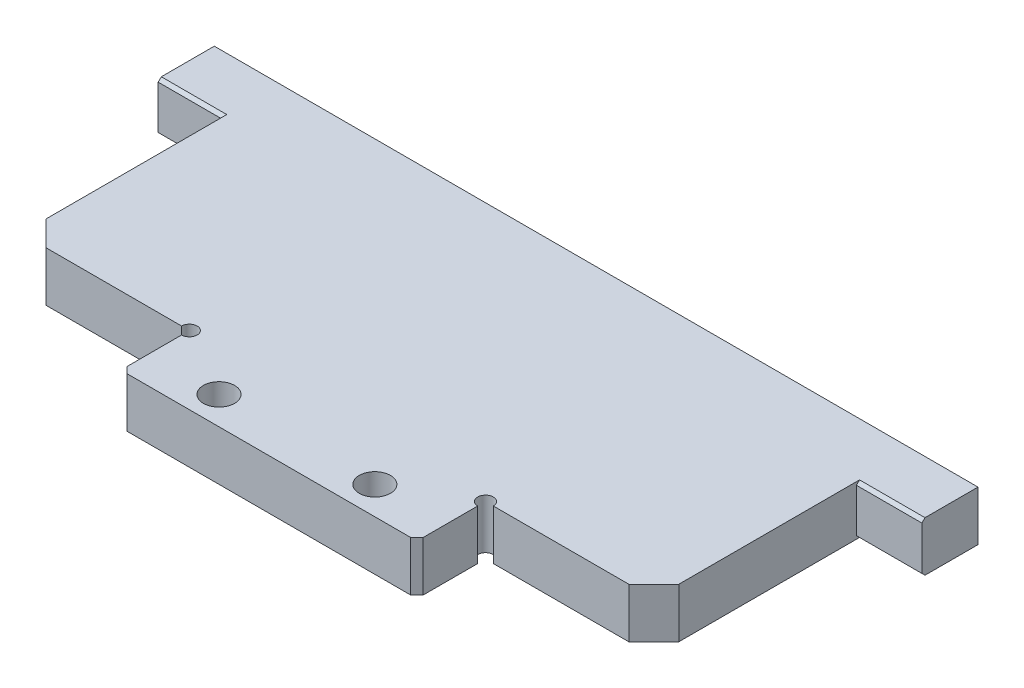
from build123d import *

# Parameters (mm, degrees)
SKETCH1_W           = 245
SKETCH1_H           = 105
BOSS_EXTRUDE1_DEPTH = 16
SKETCH2_W           = 75
SKETCH2_H           = 22
CUT_EXTRUDE1_DEPTH  = 163.133432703
SKETCH3_R           = 2.5
CUT_EXTRUDE2_DEPTH  = 163.133432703
CHAMFER1_SIZE       = 2
SKETCH4_R           = 5
CUT_EXTRUDE3_DEPTH  = 163.133432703
SKETCH5_W           = 21
SKETCH5_H           = 65
CUT_EXTRUDE4_DEPTH  = 163.133432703
CHAMFER2_SIZE       = 8
CHAMFER3_SIZE       = 1


with BuildPart() as part:
    # Sketch1 → Boss-Extrude1 (new body)
    with BuildSketch(Plane(origin=(0, 0, 0), x_dir=(1, 0, 0), z_dir=(0, 1, 0))):
        with Locations((0, 52.5)):
            Rectangle(SKETCH1_W, SKETCH1_H)
    extrude(amount=BOSS_EXTRUDE1_DEPTH)

    # Sketch2 → Cut-Extrude1 (cut, through all)
    with BuildSketch(Plane(origin=(0, 16, 0), x_dir=(1, 0, 0), z_dir=(0, 1, 0))):
        with Locations((-85, 11)):
            Rectangle(SKETCH2_W, SKETCH2_H)
        with Locations((85, 11)):
            Rectangle(SKETCH2_W, SKETCH2_H)
    extrude(amount=-CUT_EXTRUDE1_DEPTH, mode=Mode.SUBTRACT)

    # Sketch3 → Cut-Extrude2 (cut, through all)
    with BuildSketch(Plane(origin=(0, 16, 0), x_dir=(1, 0, 0), z_dir=(0, 1, 0))):
        with Locations((-47.5, 22)):
            Circle(SKETCH3_R)
        with Locations((47.5, 22)):
            Circle(SKETCH3_R)
    extrude(amount=-CUT_EXTRUDE2_DEPTH, mode=Mode.SUBTRACT)

    # Chamfer1
    chamfer1_edges = [part.edges().sort_by_distance(p)[0] for p in [
        (-47.5, 8, 0),
        (47.5, 8, 0),
    ]]
    chamfer(chamfer1_edges, length=CHAMFER1_SIZE)

    # Sketch4 → Cut-Extrude3 (cut, through all)
    with BuildSketch(Plane(origin=(0, 16, 0), x_dir=(1, 0, 0), z_dir=(0, 1, 0))):
        with Locations(Location((-25, 9, 0), (0, 0, 270))):
            Circle(SKETCH4_R)
        with Locations(Location((25, 9, 0), (0, 0, 270))):
            Circle(SKETCH4_R)
    extrude(amount=-CUT_EXTRUDE3_DEPTH, mode=Mode.SUBTRACT)

    # Sketch5 → Cut-Extrude4 (cut, through all)
    with BuildSketch(Plane(origin=(0, 16, 0), x_dir=(1, 0, 0), z_dir=(0, 1, 0))):
        with Locations((-112, 54.5)):
            Rectangle(SKETCH5_W, SKETCH5_H)
        with Locations((112, 54.5)):
            Rectangle(SKETCH5_W, SKETCH5_H)
    extrude(amount=-CUT_EXTRUDE4_DEPTH, mode=Mode.SUBTRACT)

    # Chamfer2
    chamfer2_edges = [part.edges().sort_by_distance(p)[0] for p in [
        (-101.5, 8, -22),
        (101.5, 8, -22),
    ]]
    chamfer(chamfer2_edges, length=CHAMFER2_SIZE)

    # Chamfer3
    chamfer3_edges = [part.edges().sort_by_distance(p)[0] for p in [
        (-112, 0, -87),
        (-112, 16, -87),
        (112, 0, -87),
        (112, 16, -87),
    ]]
    chamfer(chamfer3_edges, length=CHAMFER3_SIZE)


solid = part.part
